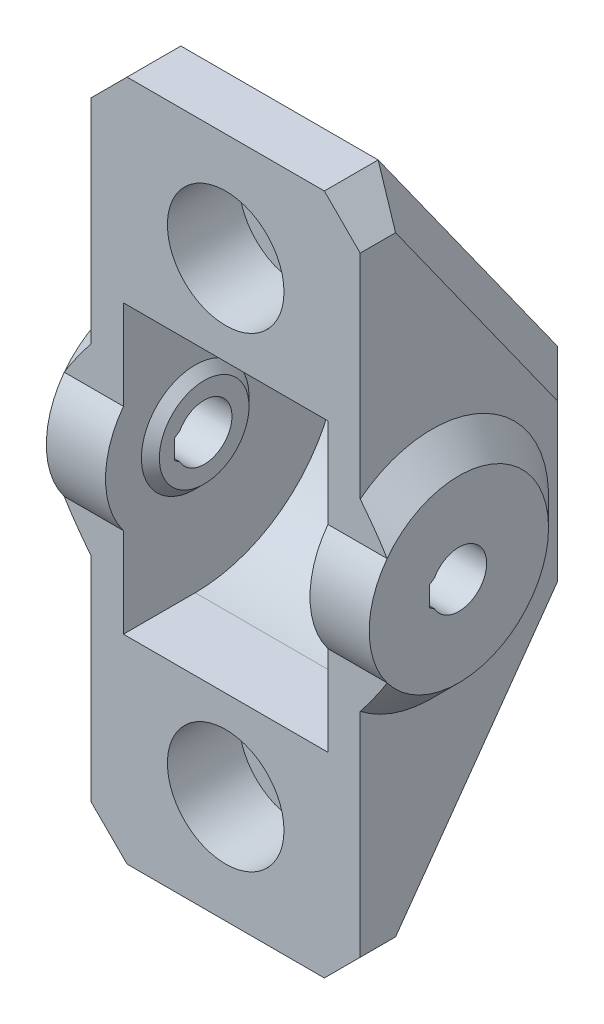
ISO-10303-21;
HEADER;
FILE_DESCRIPTION(('STEP AP214'),'2;1');
FILE_NAME('part.step','',(''),(''),'','','');
FILE_SCHEMA(('AUTOMOTIVE_DESIGN { 1 0 10303 214 1 1 1 1 }'));
ENDSEC;
DATA;
#1=APPLICATION_CONTEXT('core data for automotive mechanical design processes');
#2=APPLICATION_PROTOCOL_DEFINITION('international standard','automotive_design',2000,#1);
#3=PRODUCT_CONTEXT('',#1,'mechanical');
#4=PRODUCT('Part','Part','',(#3));
#5=PRODUCT_RELATED_PRODUCT_CATEGORY('part','',(#4));
#6=PRODUCT_DEFINITION_FORMATION('','',#4);
#7=PRODUCT_DEFINITION_CONTEXT('part definition',#1,'design');
#8=PRODUCT_DEFINITION('design','',#6,#7);
#9=PRODUCT_DEFINITION_SHAPE('','',#8);
#10=(LENGTH_UNIT() NAMED_UNIT(*) SI_UNIT(.MILLI.,.METRE.));
#11=(NAMED_UNIT(*) PLANE_ANGLE_UNIT() SI_UNIT($,.RADIAN.));
#12=(NAMED_UNIT(*) SI_UNIT($,.STERADIAN.) SOLID_ANGLE_UNIT());
#13=UNCERTAINTY_MEASURE_WITH_UNIT(LENGTH_MEASURE(1.E-05),#10,'distance_accuracy_value','');
#14=(GEOMETRIC_REPRESENTATION_CONTEXT(3) GLOBAL_UNCERTAINTY_ASSIGNED_CONTEXT((#13)) GLOBAL_UNIT_ASSIGNED_CONTEXT((#10,
#11,#12)) REPRESENTATION_CONTEXT('',''));
#15=CARTESIAN_POINT('',(0.,0.,0.));
#16=DIRECTION('',(0.,0.,1.));
#17=DIRECTION('',(1.,0.,0.));
#18=AXIS2_PLACEMENT_3D('',#15,#16,#17);
#19=CARTESIAN_POINT('',(0.,0.,16.));
#20=DIRECTION('',(0.,0.,-1.));
#21=DIRECTION('',(-1.,0.,0.));
#22=AXIS2_PLACEMENT_3D('',#19,#20,#21);
#23=PLANE('',#22);
#24=CARTESIAN_POINT('',(0.,13.,16.));
#25=DIRECTION('',(0.,0.,1.));
#26=DIRECTION('',(1.,0.,0.));
#27=AXIS2_PLACEMENT_3D('',#24,#25,#26);
#28=CIRCLE('',#27,3.25);
#29=CARTESIAN_POINT('',(3.25,13.,16.));
#30=VERTEX_POINT('',#29);
#31=EDGE_CURVE('E315',#30,#30,#28,.T.);
#32=ORIENTED_EDGE('',*,*,#31,.F.);
#33=EDGE_LOOP('',(#32));
#34=FACE_BOUND('',#33,.T.);
#35=DIRECTION('',(-1.,0.,0.));
#36=VECTOR('',#35,1.);
#37=CARTESIAN_POINT('',(7.5,19.,16.));
#38=LINE('',#37,#36);
#39=CARTESIAN_POINT('',(5.50000000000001,19.,16.));
#40=VERTEX_POINT('',#39);
#41=CARTESIAN_POINT('',(-5.49999999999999,19.,16.));
#42=VERTEX_POINT('',#41);
#43=EDGE_CURVE('E386',#40,#42,#38,.T.);
#44=ORIENTED_EDGE('',*,*,#43,.T.);
#45=DIRECTION('',(0.707106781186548,0.707106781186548,0.));
#46=VECTOR('',#45,1.);
#47=CARTESIAN_POINT('',(-7.5,17.,16.));
#48=LINE('',#47,#46);
#49=CARTESIAN_POINT('',(-7.5,17.,16.));
#50=VERTEX_POINT('',#49);
#51=EDGE_CURVE('E495',#42,#50,#48,.F.);
#52=ORIENTED_EDGE('',*,*,#51,.T.);
#53=DIRECTION('',(0.,-1.,0.));
#54=VECTOR('',#53,1.);
#55=CARTESIAN_POINT('',(-7.5,19.,16.));
#56=LINE('',#55,#54);
#57=CARTESIAN_POINT('',(-7.5,5.12347538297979,16.));
#58=VERTEX_POINT('',#57);
#59=EDGE_CURVE('E378',#50,#58,#56,.T.);
#60=ORIENTED_EDGE('',*,*,#59,.T.);
#61=CARTESIAN_POINT('',(-7.5,5.12347538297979,16.));
#62=CARTESIAN_POINT('',(-7.56711714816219,5.03832196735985,16.));
#63=CARTESIAN_POINT('',(-7.63384766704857,4.95286351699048,16.));
#64=CARTESIAN_POINT('',(-7.76642428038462,4.78125929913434,16.));
#65=CARTESIAN_POINT('',(-7.83227034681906,4.69511351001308,16.));
#66=CARTESIAN_POINT('',(-8.0281795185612,4.43570850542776,16.));
#67=CARTESIAN_POINT('',(-8.15674680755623,4.26131350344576,16.));
#68=CARTESIAN_POINT('',(-8.40870004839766,3.90869296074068,16.));
#69=CARTESIAN_POINT('',(-8.53208403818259,3.7304660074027,16.));
#70=CARTESIAN_POINT('',(-8.71192373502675,3.45952365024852,16.));
#71=CARTESIAN_POINT('',(-8.77102477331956,3.36856455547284,16.));
#72=CARTESIAN_POINT('',(-8.88715085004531,3.18531455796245,16.));
#73=CARTESIAN_POINT('',(-8.94417559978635,3.09302347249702,16.));
#74=CARTESIAN_POINT('',(-8.99999999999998,2.99999999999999,16.));
#75=B_SPLINE_CURVE_WITH_KNOTS('',3,(#61,#62,#63,#64,#65,#66,#67,#68,#69,#70,#71,#72,#73,#74),
.UNSPECIFIED.,.F.,.F.,(4,2,2,2,2,2,4),(0.,0.325271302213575,0.65055288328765,1.3004726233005,
1.95063620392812,2.27603142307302,2.60147171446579),.UNSPECIFIED.);
#76=CARTESIAN_POINT('',(-9.,2.99999999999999,16.));
#77=VERTEX_POINT('',#76);
#78=EDGE_CURVE('E445',#58,#77,#75,.T.);
#79=ORIENTED_EDGE('',*,*,#78,.T.);
#80=DIRECTION('',(1.,0.,0.));
#81=VECTOR('',#80,1.);
#82=CARTESIAN_POINT('',(-32.1421356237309,2.99999999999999,16.));
#83=LINE('',#82,#81);
#84=CARTESIAN_POINT('',(-5.7,2.99999999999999,16.));
#85=VERTEX_POINT('',#84);
#86=EDGE_CURVE('E284',#77,#85,#83,.T.);
#87=ORIENTED_EDGE('',*,*,#86,.T.);
#88=DIRECTION('',(0.,-1.,0.));
#89=VECTOR('',#88,1.);
#90=CARTESIAN_POINT('',(-5.7,8.,16.));
#91=LINE('',#90,#89);
#92=CARTESIAN_POINT('',(-5.7,8.,16.));
#93=VERTEX_POINT('',#92);
#94=EDGE_CURVE('E351',#93,#85,#91,.T.);
#95=ORIENTED_EDGE('',*,*,#94,.F.);
#96=DIRECTION('',(1.,0.,0.));
#97=VECTOR('',#96,1.);
#98=CARTESIAN_POINT('',(-5.7,8.,16.));
#99=LINE('',#98,#97);
#100=CARTESIAN_POINT('',(5.7,8.,16.));
#101=VERTEX_POINT('',#100);
#102=EDGE_CURVE('E374',#93,#101,#99,.T.);
#103=ORIENTED_EDGE('',*,*,#102,.T.);
#104=DIRECTION('',(0.,-1.,0.));
#105=VECTOR('',#104,1.);
#106=CARTESIAN_POINT('',(5.7,8.,16.));
#107=LINE('',#106,#105);
#108=CARTESIAN_POINT('',(5.7,2.99999999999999,16.));
#109=VERTEX_POINT('',#108);
#110=EDGE_CURVE('E364',#101,#109,#107,.T.);
#111=ORIENTED_EDGE('',*,*,#110,.T.);
#112=DIRECTION('',(-1.,0.,0.));
#113=VECTOR('',#112,1.);
#114=CARTESIAN_POINT('',(32.1421356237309,2.99999999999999,16.));
#115=LINE('',#114,#113);
#116=CARTESIAN_POINT('',(9.,2.99999999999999,16.));
#117=VERTEX_POINT('',#116);
#118=EDGE_CURVE('E294',#109,#117,#115,.F.);
#119=ORIENTED_EDGE('',*,*,#118,.T.);
#120=CARTESIAN_POINT('',(8.99999999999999,2.99999999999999,16.));
#121=CARTESIAN_POINT('',(8.94417559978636,3.09302347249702,16.));
#122=CARTESIAN_POINT('',(8.88715085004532,3.18531455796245,16.));
#123=CARTESIAN_POINT('',(8.77102477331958,3.36856455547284,16.));
#124=CARTESIAN_POINT('',(8.71192373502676,3.45952365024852,16.));
#125=CARTESIAN_POINT('',(8.5320840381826,3.7304660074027,16.));
#126=CARTESIAN_POINT('',(8.40870004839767,3.90869296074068,16.));
#127=CARTESIAN_POINT('',(8.15674680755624,4.26131350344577,16.));
#128=CARTESIAN_POINT('',(8.02817951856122,4.43570850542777,16.));
#129=CARTESIAN_POINT('',(7.83227034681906,4.69511351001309,16.));
#130=CARTESIAN_POINT('',(7.76642428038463,4.78125929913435,16.));
#131=CARTESIAN_POINT('',(7.63384766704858,4.95286351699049,16.));
#132=CARTESIAN_POINT('',(7.56711714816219,5.03832196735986,16.));
#133=CARTESIAN_POINT('',(7.5,5.1234753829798,16.));
#134=B_SPLINE_CURVE_WITH_KNOTS('',3,(#120,#121,#122,#123,#124,#125,#126,#127,#128,#129,#130,
#131,#132,#133),.UNSPECIFIED.,.F.,.F.,(4,2,2,2,2,2,4),(0.,0.32544029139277,0.650835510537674,
1.3009990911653,1.95091883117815,2.27620041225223,2.60147171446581),.UNSPECIFIED.);
#135=CARTESIAN_POINT('',(7.5,5.1234753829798,16.));
#136=VERTEX_POINT('',#135);
#137=EDGE_CURVE('E416',#117,#136,#134,.T.);
#138=ORIENTED_EDGE('',*,*,#137,.T.);
#139=DIRECTION('',(0.,1.,0.));
#140=VECTOR('',#139,1.);
#141=CARTESIAN_POINT('',(7.5,19.,16.));
#142=LINE('',#141,#140);
#143=CARTESIAN_POINT('',(7.5,17.,16.));
#144=VERTEX_POINT('',#143);
#145=EDGE_CURVE('E383',#136,#144,#142,.T.);
#146=ORIENTED_EDGE('',*,*,#145,.T.);
#147=DIRECTION('',(0.707106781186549,-0.707106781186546,0.));
#148=VECTOR('',#147,1.);
#149=CARTESIAN_POINT('',(5.50000000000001,19.,16.));
#150=LINE('',#149,#148);
#151=EDGE_CURVE('E493',#144,#40,#150,.F.);
#152=ORIENTED_EDGE('',*,*,#151,.T.);
#153=EDGE_LOOP('',(#44,#52,#60,#79,#87,#95,#103,#111,#119,#138,#146,#152));
#154=FACE_BOUND('',#153,.T.);
#155=ADVANCED_FACE('F39',(#34,#154),#23,.F.);
#156=CARTESIAN_POINT('',(-7.5,19.,16.));
#157=DIRECTION('',(1.,0.,0.));
#158=DIRECTION('',(0.,1.,0.));
#159=AXIS2_PLACEMENT_3D('',#156,#157,#158);
#160=PLANE('',#159);
#161=DIRECTION('',(0.,-0.813733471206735,0.581238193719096));
#162=VECTOR('',#161,1.);
#163=CARTESIAN_POINT('',(-7.49999999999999,-17.8375236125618,14.6274669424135));
#164=LINE('',#163,#162);
#165=CARTESIAN_POINT('',(-7.5,-4.35906989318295,5.00000000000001));
#166=VERTEX_POINT('',#165);
#167=CARTESIAN_POINT('',(-7.49999999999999,-17.,14.0292357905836));
#168=VERTEX_POINT('',#167);
#169=EDGE_CURVE('E468',#166,#168,#164,.T.);
#170=ORIENTED_EDGE('',*,*,#169,.T.);
#171=DIRECTION('',(0.,0.,1.));
#172=VECTOR('',#171,1.);
#173=CARTESIAN_POINT('',(-7.49999999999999,-17.,16.));
#174=LINE('',#173,#172);
#175=CARTESIAN_POINT('',(-7.49999999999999,-17.,16.));
#176=VERTEX_POINT('',#175);
#177=EDGE_CURVE('E470',#168,#176,#174,.T.);
#178=ORIENTED_EDGE('',*,*,#177,.T.);
#179=CARTESIAN_POINT('',(-7.5,-5.12347538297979,16.));
#180=VERTEX_POINT('',#179);
#181=EDGE_CURVE('E370',#180,#176,#56,.T.);
#182=ORIENTED_EDGE('',*,*,#181,.F.);
#183=CARTESIAN_POINT('',(-7.5,0.,12.));
#184=DIRECTION('',(1.,0.,0.));
#185=DIRECTION('',(0.,1.,0.));
#186=AXIS2_PLACEMENT_3D('',#183,#184,#185);
#187=CIRCLE('',#186,6.49999999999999);
#188=EDGE_CURVE('E404',#180,#58,#187,.T.);
#189=ORIENTED_EDGE('',*,*,#188,.T.);
#190=ORIENTED_EDGE('',*,*,#59,.F.);
#191=DIRECTION('',(0.,0.,-1.));
#192=VECTOR('',#191,1.);
#193=CARTESIAN_POINT('',(-7.5,17.,16.));
#194=LINE('',#193,#192);
#195=CARTESIAN_POINT('',(-7.5,17.,14.0292357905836));
#196=VERTEX_POINT('',#195);
#197=EDGE_CURVE('E462',#50,#196,#194,.T.);
#198=ORIENTED_EDGE('',*,*,#197,.T.);
#199=DIRECTION('',(0.,-0.813733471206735,-0.581238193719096));
#200=VECTOR('',#199,1.);
#201=CARTESIAN_POINT('',(-7.5,19.2564425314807,15.640980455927));
#202=LINE('',#201,#200);
#203=CARTESIAN_POINT('',(-7.5,4.35906989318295,5.00000000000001));
#204=VERTEX_POINT('',#203);
#205=EDGE_CURVE('E464',#196,#204,#202,.T.);
#206=ORIENTED_EDGE('',*,*,#205,.T.);
#207=DIRECTION('',(0.,-1.,0.));
#208=VECTOR('',#207,1.);
#209=CARTESIAN_POINT('',(-7.5,19.,5.00000000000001));
#210=LINE('',#209,#208);
#211=EDGE_CURVE('E466',#204,#166,#210,.T.);
#212=ORIENTED_EDGE('',*,*,#211,.T.);
#213=EDGE_LOOP('',(#170,#178,#182,#189,#190,#198,#206,#212));
#214=FACE_BOUND('',#213,.T.);
#215=ADVANCED_FACE('F572',(#214),#160,.F.);
#216=CARTESIAN_POINT('',(7.50000000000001,-19.,16.));
#217=DIRECTION('',(0.,1.,0.));
#218=DIRECTION('',(-1.,0.,0.));
#219=AXIS2_PLACEMENT_3D('',#216,#217,#218);
#220=PLANE('',#219);
#221=DIRECTION('',(1.,0.,0.));
#222=VECTOR('',#221,1.);
#223=CARTESIAN_POINT('',(7.50000000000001,-19.,16.));
#224=LINE('',#223,#222);
#225=CARTESIAN_POINT('',(-5.49999999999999,-19.,16.));
#226=VERTEX_POINT('',#225);
#227=CARTESIAN_POINT('',(5.50000000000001,-19.,16.));
#228=VERTEX_POINT('',#227);
#229=EDGE_CURVE('E380',#226,#228,#224,.T.);
#230=ORIENTED_EDGE('',*,*,#229,.F.);
#231=DIRECTION('',(0.,0.,-1.));
#232=VECTOR('',#231,1.);
#233=CARTESIAN_POINT('',(-5.49999999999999,-19.,16.));
#234=LINE('',#233,#232);
#235=CARTESIAN_POINT('',(-5.49999999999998,-19.,13.));
#236=VERTEX_POINT('',#235);
#237=EDGE_CURVE('E459',#226,#236,#234,.T.);
#238=ORIENTED_EDGE('',*,*,#237,.T.);
#239=DIRECTION('',(1.,0.,0.));
#240=VECTOR('',#239,1.);
#241=CARTESIAN_POINT('',(-7.5,-19.,13.));
#242=LINE('',#241,#240);
#243=CARTESIAN_POINT('',(5.50000000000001,-19.,13.));
#244=VERTEX_POINT('',#243);
#245=EDGE_CURVE('E302',#236,#244,#242,.T.);
#246=ORIENTED_EDGE('',*,*,#245,.T.);
#247=DIRECTION('',(0.,0.,1.));
#248=VECTOR('',#247,1.);
#249=CARTESIAN_POINT('',(5.50000000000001,-19.,16.));
#250=LINE('',#249,#248);
#251=EDGE_CURVE('E457',#244,#228,#250,.T.);
#252=ORIENTED_EDGE('',*,*,#251,.T.);
#253=EDGE_LOOP('',(#230,#238,#246,#252));
#254=FACE_BOUND('',#253,.T.);
#255=ADVANCED_FACE('F577',(#254),#220,.F.);
#256=CARTESIAN_POINT('',(7.5,19.,16.));
#257=DIRECTION('',(-1.,0.,0.));
#258=DIRECTION('',(0.,-1.,0.));
#259=AXIS2_PLACEMENT_3D('',#256,#257,#258);
#260=PLANE('',#259);
#261=DIRECTION('',(0.,0.813733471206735,0.581238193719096));
#262=VECTOR('',#261,1.);
#263=CARTESIAN_POINT('',(7.5,19.2564425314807,15.640980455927));
#264=LINE('',#263,#262);
#265=CARTESIAN_POINT('',(7.5,4.35906989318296,4.99999999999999));
#266=VERTEX_POINT('',#265);
#267=CARTESIAN_POINT('',(7.5,17.,14.0292357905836));
#268=VERTEX_POINT('',#267);
#269=EDGE_CURVE('E503',#266,#268,#264,.T.);
#270=ORIENTED_EDGE('',*,*,#269,.T.);
#271=DIRECTION('',(0.,0.,1.));
#272=VECTOR('',#271,1.);
#273=CARTESIAN_POINT('',(7.5,17.,16.));
#274=LINE('',#273,#272);
#275=EDGE_CURVE('E505',#268,#144,#274,.T.);
#276=ORIENTED_EDGE('',*,*,#275,.T.);
#277=ORIENTED_EDGE('',*,*,#145,.F.);
#278=CARTESIAN_POINT('',(7.5,0.,12.));
#279=DIRECTION('',(-1.,0.,0.));
#280=DIRECTION('',(0.,-1.,0.));
#281=AXIS2_PLACEMENT_3D('',#278,#279,#280);
#282=CIRCLE('',#281,6.5);
#283=CARTESIAN_POINT('',(7.5,-5.1234753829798,16.));
#284=VERTEX_POINT('',#283);
#285=EDGE_CURVE('E395',#136,#284,#282,.T.);
#286=ORIENTED_EDGE('',*,*,#285,.T.);
#287=CARTESIAN_POINT('',(7.50000000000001,-17.,16.));
#288=VERTEX_POINT('',#287);
#289=EDGE_CURVE('E384',#288,#284,#142,.T.);
#290=ORIENTED_EDGE('',*,*,#289,.F.);
#291=DIRECTION('',(0.,0.,-1.));
#292=VECTOR('',#291,1.);
#293=CARTESIAN_POINT('',(7.50000000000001,-17.,16.));
#294=LINE('',#293,#292);
#295=CARTESIAN_POINT('',(7.50000000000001,-17.,14.0292357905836));
#296=VERTEX_POINT('',#295);
#297=EDGE_CURVE('E497',#288,#296,#294,.T.);
#298=ORIENTED_EDGE('',*,*,#297,.T.);
#299=DIRECTION('',(0.,0.813733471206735,-0.581238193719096));
#300=VECTOR('',#299,1.);
#301=CARTESIAN_POINT('',(7.5,-3.83752361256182,4.62746694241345));
#302=LINE('',#301,#300);
#303=CARTESIAN_POINT('',(7.5,-4.35906989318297,4.99999999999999));
#304=VERTEX_POINT('',#303);
#305=EDGE_CURVE('E499',#296,#304,#302,.T.);
#306=ORIENTED_EDGE('',*,*,#305,.T.);
#307=DIRECTION('',(0.,1.,0.));
#308=VECTOR('',#307,1.);
#309=CARTESIAN_POINT('',(7.5,19.,4.99999999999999));
#310=LINE('',#309,#308);
#311=EDGE_CURVE('E501',#304,#266,#310,.T.);
#312=ORIENTED_EDGE('',*,*,#311,.T.);
#313=EDGE_LOOP('',(#270,#276,#277,#286,#290,#298,#306,#312));
#314=FACE_BOUND('',#313,.T.);
#315=ADVANCED_FACE('F592',(#314),#260,.F.);
#316=CARTESIAN_POINT('',(0.,-13.,16.));
#317=DIRECTION('',(0.,0.,1.));
#318=DIRECTION('',(1.,0.,0.));
#319=AXIS2_PLACEMENT_3D('',#316,#317,#318);
#320=CYLINDRICAL_SURFACE('',#319,1.7);
#321=CARTESIAN_POINT('',(0.,-13.,12.));
#322=DIRECTION('',(0.,0.,1.));
#323=DIRECTION('',(1.,0.,0.));
#324=AXIS2_PLACEMENT_3D('',#321,#322,#323);
#325=CIRCLE('',#324,1.7);
#326=CARTESIAN_POINT('',(1.7,-13.,12.));
#327=VERTEX_POINT('',#326);
#328=EDGE_CURVE('E330',#327,#327,#325,.T.);
#329=ORIENTED_EDGE('',*,*,#328,.T.);
#330=EDGE_LOOP('',(#329));
#331=FACE_BOUND('',#330,.T.);
#332=CARTESIAN_POINT('',(0.,-13.,8.71428571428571));
#333=DIRECTION('',(0.,-0.581238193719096,-0.813733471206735));
#334=DIRECTION('',(0.,-0.813733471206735,0.581238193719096));
#335=AXIS2_PLACEMENT_3D('',#332,#333,#334);
#336=ELLIPSE('',#335,2.08913613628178,1.7);
#337=CARTESIAN_POINT('',(0.,-14.7,9.92857142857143));
#338=VERTEX_POINT('',#337);
#339=EDGE_CURVE('E305',#338,#338,#336,.F.);
#340=ORIENTED_EDGE('',*,*,#339,.F.);
#341=EDGE_LOOP('',(#340));
#342=FACE_BOUND('',#341,.T.);
#343=ADVANCED_FACE('F584',(#331,#342),#320,.F.);
#344=CARTESIAN_POINT('',(0.,-13.,16.));
#345=DIRECTION('',(0.,0.,1.));
#346=DIRECTION('',(1.,0.,0.));
#347=AXIS2_PLACEMENT_3D('',#344,#345,#346);
#348=CIRCLE('',#347,3.25);
#349=CARTESIAN_POINT('',(3.25,-13.,16.));
#350=VERTEX_POINT('',#349);
#351=EDGE_CURVE('E324',#350,#350,#348,.T.);
#352=ORIENTED_EDGE('',*,*,#351,.F.);
#353=EDGE_LOOP('',(#352));
#354=FACE_BOUND('',#353,.T.);
#355=ORIENTED_EDGE('',*,*,#181,.T.);
#356=DIRECTION('',(-0.707106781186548,0.707106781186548,0.));
#357=VECTOR('',#356,1.);
#358=CARTESIAN_POINT('',(-5.49999999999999,-19.,16.));
#359=LINE('',#358,#357);
#360=EDGE_CURVE('E474',#176,#226,#359,.F.);
#361=ORIENTED_EDGE('',*,*,#360,.T.);
#362=ORIENTED_EDGE('',*,*,#229,.T.);
#363=DIRECTION('',(-0.707106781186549,-0.707106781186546,0.));
#364=VECTOR('',#363,1.);
#365=CARTESIAN_POINT('',(7.50000000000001,-17.,16.));
#366=LINE('',#365,#364);
#367=EDGE_CURVE('E472',#228,#288,#366,.F.);
#368=ORIENTED_EDGE('',*,*,#367,.T.);
#369=ORIENTED_EDGE('',*,*,#289,.T.);
#370=CARTESIAN_POINT('',(7.5,-5.1234753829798,16.));
#371=CARTESIAN_POINT('',(7.56711714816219,-5.03832196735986,16.));
#372=CARTESIAN_POINT('',(7.63384766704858,-4.95286351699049,16.));
#373=CARTESIAN_POINT('',(7.76642428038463,-4.78125929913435,16.));
#374=CARTESIAN_POINT('',(7.83227034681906,-4.69511351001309,16.));
#375=CARTESIAN_POINT('',(8.02817951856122,-4.43570850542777,16.));
#376=CARTESIAN_POINT('',(8.15674680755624,-4.26131350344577,16.));
#377=CARTESIAN_POINT('',(8.40870004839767,-3.90869296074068,16.));
#378=CARTESIAN_POINT('',(8.5320840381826,-3.7304660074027,16.));
#379=CARTESIAN_POINT('',(8.71192373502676,-3.45952365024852,16.));
#380=CARTESIAN_POINT('',(8.77102477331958,-3.36856455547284,16.));
#381=CARTESIAN_POINT('',(8.88715085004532,-3.18531455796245,16.));
#382=CARTESIAN_POINT('',(8.94417559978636,-3.09302347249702,16.));
#383=CARTESIAN_POINT('',(8.99999999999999,-2.99999999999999,16.));
#384=B_SPLINE_CURVE_WITH_KNOTS('',3,(#370,#371,#372,#373,#374,#375,#376,#377,#378,#379,#380,
#381,#382,#383),.UNSPECIFIED.,.F.,.F.,(4,2,2,2,2,2,4),(0.,0.325271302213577,0.650552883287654,
1.3004726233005,1.95063620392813,2.27603142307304,2.60147171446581),.UNSPECIFIED.);
#385=CARTESIAN_POINT('',(9.,-2.99999999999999,16.));
#386=VERTEX_POINT('',#385);
#387=EDGE_CURVE('E407',#284,#386,#384,.T.);
#388=ORIENTED_EDGE('',*,*,#387,.T.);
#389=DIRECTION('',(-1.,0.,0.));
#390=VECTOR('',#389,1.);
#391=CARTESIAN_POINT('',(32.1421356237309,-2.99999999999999,16.));
#392=LINE('',#391,#390);
#393=CARTESIAN_POINT('',(5.7,-2.99999999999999,16.));
#394=VERTEX_POINT('',#393);
#395=EDGE_CURVE('E298',#386,#394,#392,.T.);
#396=ORIENTED_EDGE('',*,*,#395,.T.);
#397=CARTESIAN_POINT('',(5.7,-8.,16.));
#398=VERTEX_POINT('',#397);
#399=EDGE_CURVE('E363',#394,#398,#107,.T.);
#400=ORIENTED_EDGE('',*,*,#399,.T.);
#401=DIRECTION('',(1.,0.,0.));
#402=VECTOR('',#401,1.);
#403=CARTESIAN_POINT('',(-5.7,-8.,16.));
#404=LINE('',#403,#402);
#405=CARTESIAN_POINT('',(-5.7,-8.,16.));
#406=VERTEX_POINT('',#405);
#407=EDGE_CURVE('E371',#406,#398,#404,.T.);
#408=ORIENTED_EDGE('',*,*,#407,.F.);
#409=CARTESIAN_POINT('',(-5.7,-2.99999999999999,16.));
#410=VERTEX_POINT('',#409);
#411=EDGE_CURVE('E350',#410,#406,#91,.T.);
#412=ORIENTED_EDGE('',*,*,#411,.F.);
#413=DIRECTION('',(1.,0.,0.));
#414=VECTOR('',#413,1.);
#415=CARTESIAN_POINT('',(-32.1421356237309,-2.99999999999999,16.));
#416=LINE('',#415,#414);
#417=CARTESIAN_POINT('',(-9.,-2.99999999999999,16.));
#418=VERTEX_POINT('',#417);
#419=EDGE_CURVE('E282',#410,#418,#416,.F.);
#420=ORIENTED_EDGE('',*,*,#419,.T.);
#421=CARTESIAN_POINT('',(-8.99999999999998,-2.99999999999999,16.));
#422=CARTESIAN_POINT('',(-8.94417559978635,-3.09302347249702,16.));
#423=CARTESIAN_POINT('',(-8.88715085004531,-3.18531455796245,16.));
#424=CARTESIAN_POINT('',(-8.77102477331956,-3.36856455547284,16.));
#425=CARTESIAN_POINT('',(-8.71192373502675,-3.45952365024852,16.));
#426=CARTESIAN_POINT('',(-8.53208403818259,-3.7304660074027,16.));
#427=CARTESIAN_POINT('',(-8.40870004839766,-3.90869296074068,16.));
#428=CARTESIAN_POINT('',(-8.15674680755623,-4.26131350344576,16.));
#429=CARTESIAN_POINT('',(-8.0281795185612,-4.43570850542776,16.));
#430=CARTESIAN_POINT('',(-7.83227034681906,-4.69511351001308,16.));
#431=CARTESIAN_POINT('',(-7.76642428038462,-4.78125929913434,16.));
#432=CARTESIAN_POINT('',(-7.63384766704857,-4.95286351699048,16.));
#433=CARTESIAN_POINT('',(-7.56711714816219,-5.03832196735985,16.));
#434=CARTESIAN_POINT('',(-7.5,-5.12347538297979,16.));
#435=B_SPLINE_CURVE_WITH_KNOTS('',3,(#421,#422,#423,#424,#425,#426,#427,#428,#429,#430,#431,
#432,#433,#434),.UNSPECIFIED.,.F.,.F.,(4,2,2,2,2,2,4),(0.,0.32544029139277,0.650835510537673,
1.3009990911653,1.95091883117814,2.27620041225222,2.6014717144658),.UNSPECIFIED.);
#436=EDGE_CURVE('E451',#418,#180,#435,.T.);
#437=ORIENTED_EDGE('',*,*,#436,.T.);
#438=EDGE_LOOP('',(#355,#361,#362,#368,#369,#388,#396,#400,#408,#412,#420,#437));
#439=FACE_BOUND('',#438,.T.);
#440=ADVANCED_FACE('F422',(#354,#439),#23,.F.);
#441=CARTESIAN_POINT('',(7.5,19.,16.));
#442=DIRECTION('',(0.,-1.,0.));
#443=DIRECTION('',(1.,0.,0.));
#444=AXIS2_PLACEMENT_3D('',#441,#442,#443);
#445=PLANE('',#444);
#446=DIRECTION('',(1.,0.,0.));
#447=VECTOR('',#446,1.);
#448=CARTESIAN_POINT('',(-7.5,19.,13.));
#449=LINE('',#448,#447);
#450=CARTESIAN_POINT('',(-5.49999999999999,19.,13.));
#451=VERTEX_POINT('',#450);
#452=CARTESIAN_POINT('',(5.50000000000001,19.,13.));
#453=VERTEX_POINT('',#452);
#454=EDGE_CURVE('E312',#451,#453,#449,.T.);
#455=ORIENTED_EDGE('',*,*,#454,.F.);
#456=DIRECTION('',(0.,0.,1.));
#457=VECTOR('',#456,1.);
#458=CARTESIAN_POINT('',(-5.49999999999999,19.,16.));
#459=LINE('',#458,#457);
#460=EDGE_CURVE('E491',#451,#42,#459,.T.);
#461=ORIENTED_EDGE('',*,*,#460,.T.);
#462=ORIENTED_EDGE('',*,*,#43,.F.);
#463=DIRECTION('',(0.,0.,-1.));
#464=VECTOR('',#463,1.);
#465=CARTESIAN_POINT('',(5.50000000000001,19.,16.));
#466=LINE('',#465,#464);
#467=EDGE_CURVE('E488',#40,#453,#466,.T.);
#468=ORIENTED_EDGE('',*,*,#467,.T.);
#469=EDGE_LOOP('',(#455,#461,#462,#468));
#470=FACE_BOUND('',#469,.T.);
#471=ADVANCED_FACE('F583',(#470),#445,.F.);
#472=CARTESIAN_POINT('',(-5.7,0.,12.));
#473=DIRECTION('',(1.,0.,0.));
#474=DIRECTION('',(0.,0.,-1.));
#475=AXIS2_PLACEMENT_3D('',#472,#473,#474);
#476=CYLINDRICAL_SURFACE('',#475,8.);
#477=CARTESIAN_POINT('',(5.7,0.,12.));
#478=DIRECTION('',(1.,0.,0.));
#479=DIRECTION('',(0.,0.,-1.));
#480=AXIS2_PLACEMENT_3D('',#477,#478,#479);
#481=CIRCLE('',#480,8.);
#482=CARTESIAN_POINT('',(5.7,-8.,12.));
#483=VERTEX_POINT('',#482);
#484=CARTESIAN_POINT('',(5.7,8.,12.));
#485=VERTEX_POINT('',#484);
#486=EDGE_CURVE('E342',#483,#485,#481,.T.);
#487=ORIENTED_EDGE('',*,*,#486,.T.);
#488=DIRECTION('',(1.,0.,0.));
#489=VECTOR('',#488,1.);
#490=CARTESIAN_POINT('',(-5.7,8.,12.));
#491=LINE('',#490,#489);
#492=CARTESIAN_POINT('',(-5.7,8.,12.));
#493=VERTEX_POINT('',#492);
#494=EDGE_CURVE('E357',#493,#485,#491,.T.);
#495=ORIENTED_EDGE('',*,*,#494,.F.);
#496=CARTESIAN_POINT('',(-5.7,0.,12.));
#497=DIRECTION('',(1.,0.,0.));
#498=DIRECTION('',(0.,0.,-1.));
#499=AXIS2_PLACEMENT_3D('',#496,#497,#498);
#500=CIRCLE('',#499,8.);
#501=CARTESIAN_POINT('',(-5.7,-8.,12.));
#502=VERTEX_POINT('',#501);
#503=EDGE_CURVE('E343',#502,#493,#500,.T.);
#504=ORIENTED_EDGE('',*,*,#503,.F.);
#505=DIRECTION('',(1.,0.,0.));
#506=VECTOR('',#505,1.);
#507=CARTESIAN_POINT('',(-5.7,-8.,12.));
#508=LINE('',#507,#506);
#509=EDGE_CURVE('E368',#502,#483,#508,.T.);
#510=ORIENTED_EDGE('',*,*,#509,.T.);
#511=EDGE_LOOP('',(#487,#495,#504,#510));
#512=FACE_BOUND('',#511,.T.);
#513=ADVANCED_FACE('F590',(#512),#476,.F.);
#514=CARTESIAN_POINT('',(-5.7,-8.,12.));
#515=DIRECTION('',(0.,-1.,0.));
#516=DIRECTION('',(0.,0.,-1.));
#517=AXIS2_PLACEMENT_3D('',#514,#515,#516);
#518=PLANE('',#517);
#519=DIRECTION('',(0.,0.,-1.));
#520=VECTOR('',#519,1.);
#521=CARTESIAN_POINT('',(5.7,-8.,12.));
#522=LINE('',#521,#520);
#523=EDGE_CURVE('E347',#398,#483,#522,.T.);
#524=ORIENTED_EDGE('',*,*,#523,.T.);
#525=ORIENTED_EDGE('',*,*,#509,.F.);
#526=DIRECTION('',(0.,0.,-1.));
#527=VECTOR('',#526,1.);
#528=CARTESIAN_POINT('',(-5.7,-8.,12.));
#529=LINE('',#528,#527);
#530=EDGE_CURVE('E354',#406,#502,#529,.T.);
#531=ORIENTED_EDGE('',*,*,#530,.F.);
#532=ORIENTED_EDGE('',*,*,#407,.T.);
#533=EDGE_LOOP('',(#524,#525,#531,#532));
#534=FACE_BOUND('',#533,.T.);
#535=ADVANCED_FACE('F697',(#534),#518,.F.);
#536=CARTESIAN_POINT('',(-5.7,8.,12.));
#537=DIRECTION('',(0.,1.,0.));
#538=DIRECTION('',(0.,0.,1.));
#539=AXIS2_PLACEMENT_3D('',#536,#537,#538);
#540=PLANE('',#539);
#541=DIRECTION('',(0.,0.,1.));
#542=VECTOR('',#541,1.);
#543=CARTESIAN_POINT('',(5.7,8.,12.));
#544=LINE('',#543,#542);
#545=EDGE_CURVE('E360',#485,#101,#544,.T.);
#546=ORIENTED_EDGE('',*,*,#545,.T.);
#547=ORIENTED_EDGE('',*,*,#102,.F.);
#548=DIRECTION('',(0.,0.,1.));
#549=VECTOR('',#548,1.);
#550=CARTESIAN_POINT('',(-5.7,8.,12.));
#551=LINE('',#550,#549);
#552=EDGE_CURVE('E346',#493,#93,#551,.T.);
#553=ORIENTED_EDGE('',*,*,#552,.F.);
#554=ORIENTED_EDGE('',*,*,#494,.T.);
#555=EDGE_LOOP('',(#546,#547,#553,#554));
#556=FACE_BOUND('',#555,.T.);
#557=ADVANCED_FACE('F567',(#556),#540,.F.);
#558=CARTESIAN_POINT('',(-5.7,0.,12.));
#559=DIRECTION('',(1.,0.,0.));
#560=DIRECTION('',(0.,0.,-1.));
#561=AXIS2_PLACEMENT_3D('',#558,#559,#560);
#562=PLANE('',#561);
#563=ORIENTED_EDGE('',*,*,#94,.T.);
#564=CARTESIAN_POINT('',(-5.7,0.,12.));
#565=DIRECTION('',(1.,0.,0.));
#566=DIRECTION('',(0.,0.,-1.));
#567=AXIS2_PLACEMENT_3D('',#564,#565,#566);
#568=CIRCLE('',#567,5.);
#569=EDGE_CURVE('E277',#85,#410,#568,.T.);
#570=ORIENTED_EDGE('',*,*,#569,.T.);
#571=ORIENTED_EDGE('',*,*,#411,.T.);
#572=ORIENTED_EDGE('',*,*,#530,.T.);
#573=ORIENTED_EDGE('',*,*,#503,.T.);
#574=ORIENTED_EDGE('',*,*,#552,.T.);
#575=EDGE_LOOP('',(#563,#570,#571,#572,#573,#574));
#576=FACE_BOUND('',#575,.T.);
#577=CARTESIAN_POINT('',(-5.7,0.,12.));
#578=DIRECTION('',(1.,0.,0.));
#579=DIRECTION('',(0.,0.,-1.));
#580=AXIS2_PLACEMENT_3D('',#577,#578,#579);
#581=CIRCLE('',#580,2.99999999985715);
#582=CARTESIAN_POINT('',(-5.7,0.,9.00000000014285));
#583=VERTEX_POINT('',#582);
#584=EDGE_CURVE('E389',#583,#583,#581,.F.);
#585=ORIENTED_EDGE('',*,*,#584,.T.);
#586=EDGE_LOOP('',(#585));
#587=FACE_BOUND('',#586,.T.);
#588=ADVANCED_FACE('F561',(#576,#587),#562,.T.);
#589=CARTESIAN_POINT('',(5.7,0.,12.));
#590=DIRECTION('',(1.,0.,0.));
#591=DIRECTION('',(0.,0.,-1.));
#592=AXIS2_PLACEMENT_3D('',#589,#590,#591);
#593=PLANE('',#592);
#594=ORIENTED_EDGE('',*,*,#399,.F.);
#595=CARTESIAN_POINT('',(5.7,0.,12.));
#596=DIRECTION('',(-1.,0.,0.));
#597=DIRECTION('',(0.,0.,1.));
#598=AXIS2_PLACEMENT_3D('',#595,#596,#597);
#599=CIRCLE('',#598,5.);
#600=EDGE_CURVE('E288',#394,#109,#599,.T.);
#601=ORIENTED_EDGE('',*,*,#600,.T.);
#602=ORIENTED_EDGE('',*,*,#110,.F.);
#603=ORIENTED_EDGE('',*,*,#545,.F.);
#604=ORIENTED_EDGE('',*,*,#486,.F.);
#605=ORIENTED_EDGE('',*,*,#523,.F.);
#606=EDGE_LOOP('',(#594,#601,#602,#603,#604,#605));
#607=FACE_BOUND('',#606,.T.);
#608=CARTESIAN_POINT('',(5.7,0.,12.));
#609=DIRECTION('',(1.,0.,0.));
#610=DIRECTION('',(0.,0.,-1.));
#611=AXIS2_PLACEMENT_3D('',#608,#609,#610);
#612=CIRCLE('',#611,3.00000000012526);
#613=CARTESIAN_POINT('',(5.7,0.,8.99999999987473));
#614=VERTEX_POINT('',#613);
#615=EDGE_CURVE('E392',#614,#614,#612,.T.);
#616=ORIENTED_EDGE('',*,*,#615,.T.);
#617=EDGE_LOOP('',(#616));
#618=FACE_BOUND('',#617,.T.);
#619=ADVANCED_FACE('F550',(#607,#618),#593,.F.);
#620=CARTESIAN_POINT('',(5.2,0.,12.));
#621=DIRECTION('',(1.,0.,0.));
#622=DIRECTION('',(0.,0.,-1.));
#623=AXIS2_PLACEMENT_3D('',#620,#621,#622);
#624=PLANE('',#623);
#625=CARTESIAN_POINT('',(5.2,0.,12.));
#626=DIRECTION('',(1.,0.,0.));
#627=DIRECTION('',(0.,0.,-1.));
#628=AXIS2_PLACEMENT_3D('',#625,#626,#627);
#629=CIRCLE('',#628,1.55);
#630=CARTESIAN_POINT('',(5.2,-0.751005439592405,13.3559095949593));
#631=VERTEX_POINT('',#630);
#632=CARTESIAN_POINT('',(5.2,0.7510054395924,13.3559095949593));
#633=VERTEX_POINT('',#632);
#634=EDGE_CURVE('E334',#631,#633,#629,.T.);
#635=ORIENTED_EDGE('',*,*,#634,.T.);
#636=DIRECTION('',(0.,0.568608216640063,-0.822608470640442));
#637=VECTOR('',#636,1.);
#638=CARTESIAN_POINT('',(5.2,0.547722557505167,13.65));
#639=LINE('',#638,#637);
#640=CARTESIAN_POINT('',(5.2,0.547722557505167,13.65));
#641=VERTEX_POINT('',#640);
#642=EDGE_CURVE('E14',#633,#641,#639,.F.);
#643=ORIENTED_EDGE('',*,*,#642,.T.);
#644=DIRECTION('',(0.,-1.,0.));
#645=VECTOR('',#644,1.);
#646=CARTESIAN_POINT('',(5.2,0.,13.65));
#647=LINE('',#646,#645);
#648=CARTESIAN_POINT('',(5.2,-0.547722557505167,13.65));
#649=VERTEX_POINT('',#648);
#650=EDGE_CURVE('E252',#641,#649,#647,.T.);
#651=ORIENTED_EDGE('',*,*,#650,.T.);
#652=DIRECTION('',(0.,0.568608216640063,0.822608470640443));
#653=VECTOR('',#652,1.);
#654=CARTESIAN_POINT('',(5.2,-0.751005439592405,13.3559095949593));
#655=LINE('',#654,#653);
#656=EDGE_CURVE('E47',#649,#631,#655,.F.);
#657=ORIENTED_EDGE('',*,*,#656,.T.);
#658=EDGE_LOOP('',(#635,#643,#651,#657));
#659=FACE_BOUND('',#658,.T.);
#660=CARTESIAN_POINT('',(5.2,0.,12.));
#661=DIRECTION('',(1.,0.,0.));
#662=DIRECTION('',(0.,0.,-1.));
#663=AXIS2_PLACEMENT_3D('',#660,#661,#662);
#664=CIRCLE('',#663,2.5);
#665=CARTESIAN_POINT('',(5.2,0.,9.5));
#666=VERTEX_POINT('',#665);
#667=EDGE_CURVE('E336',#666,#666,#664,.T.);
#668=ORIENTED_EDGE('',*,*,#667,.F.);
#669=EDGE_LOOP('',(#668));
#670=FACE_BOUND('',#669,.T.);
#671=ADVANCED_FACE('F546',(#659,#670),#624,.F.);
#672=CARTESIAN_POINT('',(-5.2,0.,12.));
#673=DIRECTION('',(1.,0.,0.));
#674=DIRECTION('',(0.,0.,-1.));
#675=AXIS2_PLACEMENT_3D('',#672,#673,#674);
#676=PLANE('',#675);
#677=CARTESIAN_POINT('',(-5.2,0.,12.));
#678=DIRECTION('',(1.,0.,0.));
#679=DIRECTION('',(0.,0.,-1.));
#680=AXIS2_PLACEMENT_3D('',#677,#678,#679);
#681=CIRCLE('',#680,1.55);
#682=CARTESIAN_POINT('',(-5.2,-0.751005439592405,13.3559095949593));
#683=VERTEX_POINT('',#682);
#684=CARTESIAN_POINT('',(-5.2,0.7510054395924,13.3559095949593));
#685=VERTEX_POINT('',#684);
#686=EDGE_CURVE('E333',#683,#685,#681,.T.);
#687=ORIENTED_EDGE('',*,*,#686,.F.);
#688=DIRECTION('',(0.,-0.568608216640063,-0.822608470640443));
#689=VECTOR('',#688,1.);
#690=CARTESIAN_POINT('',(-5.2,-1.14240966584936,12.7896630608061));
#691=LINE('',#690,#689);
#692=CARTESIAN_POINT('',(-5.2,-0.547722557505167,13.65));
#693=VERTEX_POINT('',#692);
#694=EDGE_CURVE('E534',#683,#693,#691,.F.);
#695=ORIENTED_EDGE('',*,*,#694,.T.);
#696=DIRECTION('',(0.,-1.,0.));
#697=VECTOR('',#696,1.);
#698=CARTESIAN_POINT('',(-5.2,0.,13.65));
#699=LINE('',#698,#697);
#700=CARTESIAN_POINT('',(-5.2,0.547722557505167,13.65));
#701=VERTEX_POINT('',#700);
#702=EDGE_CURVE('E264',#701,#693,#699,.T.);
#703=ORIENTED_EDGE('',*,*,#702,.F.);
#704=DIRECTION('',(0.,-0.568608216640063,0.822608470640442));
#705=VECTOR('',#704,1.);
#706=CARTESIAN_POINT('',(-5.2,1.14240966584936,12.7896630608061));
#707=LINE('',#706,#705);
#708=EDGE_CURVE('E532',#701,#685,#707,.F.);
#709=ORIENTED_EDGE('',*,*,#708,.T.);
#710=EDGE_LOOP('',(#687,#695,#703,#709));
#711=FACE_BOUND('',#710,.T.);
#712=CARTESIAN_POINT('',(-5.2,0.,12.));
#713=DIRECTION('',(1.,0.,0.));
#714=DIRECTION('',(0.,0.,-1.));
#715=AXIS2_PLACEMENT_3D('',#712,#713,#714);
#716=CIRCLE('',#715,2.5);
#717=CARTESIAN_POINT('',(-5.2,0.,9.5));
#718=VERTEX_POINT('',#717);
#719=EDGE_CURVE('E339',#718,#718,#716,.F.);
#720=ORIENTED_EDGE('',*,*,#719,.F.);
#721=EDGE_LOOP('',(#720));
#722=FACE_BOUND('',#721,.T.);
#723=ADVANCED_FACE('F549',(#711,#722),#676,.T.);
#724=CARTESIAN_POINT('',(-5.20000000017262,0.,12.));
#725=DIRECTION('',(-1.,0.,0.));
#726=DIRECTION('',(0.,0.,1.));
#727=AXIS2_PLACEMENT_3D('',#724,#725,#726);
#728=CONICAL_SURFACE('',#727,2.5,0.785398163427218);
#729=ORIENTED_EDGE('',*,*,#584,.F.);
#730=EDGE_LOOP('',(#729));
#731=FACE_BOUND('',#730,.T.);
#732=ORIENTED_EDGE('',*,*,#719,.T.);
#733=EDGE_LOOP('',(#732));
#734=FACE_BOUND('',#733,.T.);
#735=ADVANCED_FACE('F557',(#731,#734),#728,.T.);
#736=CARTESIAN_POINT('',(5.69999999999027,0.,12.));
#737=DIRECTION('',(1.,0.,0.));
#738=DIRECTION('',(0.,0.,-1.));
#739=AXIS2_PLACEMENT_3D('',#736,#737,#738);
#740=CONICAL_SURFACE('',#739,3.00000000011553,0.785398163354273);
#741=ORIENTED_EDGE('',*,*,#667,.T.);
#742=EDGE_LOOP('',(#741));
#743=FACE_BOUND('',#742,.T.);
#744=ORIENTED_EDGE('',*,*,#615,.F.);
#745=EDGE_LOOP('',(#744));
#746=FACE_BOUND('',#745,.T.);
#747=ADVANCED_FACE('F434',(#743,#746),#740,.T.);
#748=CARTESIAN_POINT('',(-7.5,0.,12.));
#749=DIRECTION('',(1.,0.,0.));
#750=DIRECTION('',(0.,0.,-1.));
#751=AXIS2_PLACEMENT_3D('',#748,#749,#750);
#752=CYLINDRICAL_SURFACE('',#751,1.55);
#753=CARTESIAN_POINT('',(-9.,0.,12.));
#754=DIRECTION('',(1.,0.,0.));
#755=DIRECTION('',(0.,0.,-1.));
#756=AXIS2_PLACEMENT_3D('',#753,#754,#755);
#757=CIRCLE('',#756,1.55);
#758=CARTESIAN_POINT('',(-9.,0.7510054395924,13.3559095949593));
#759=VERTEX_POINT('',#758);
#760=CARTESIAN_POINT('',(-9.,-0.751005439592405,13.3559095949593));
#761=VERTEX_POINT('',#760);
#762=EDGE_CURVE('E275',#759,#761,#757,.F.);
#763=ORIENTED_EDGE('',*,*,#762,.T.);
#764=DIRECTION('',(1.,0.,0.));
#765=VECTOR('',#764,1.);
#766=CARTESIAN_POINT('',(-7.5,-0.751005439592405,13.3559095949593));
#767=LINE('',#766,#765);
#768=EDGE_CURVE('E529',#761,#683,#767,.T.);
#769=ORIENTED_EDGE('',*,*,#768,.T.);
#770=ORIENTED_EDGE('',*,*,#686,.T.);
#771=DIRECTION('',(1.,0.,0.));
#772=VECTOR('',#771,1.);
#773=CARTESIAN_POINT('',(-7.5,0.7510054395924,13.3559095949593));
#774=LINE('',#773,#772);
#775=EDGE_CURVE('E507',#685,#759,#774,.F.);
#776=ORIENTED_EDGE('',*,*,#775,.T.);
#777=EDGE_LOOP('',(#763,#769,#770,#776));
#778=FACE_BOUND('',#777,.T.);
#779=ADVANCED_FACE('F556',(#778),#752,.F.);
#780=CARTESIAN_POINT('',(9.,0.,12.));
#781=DIRECTION('',(1.,0.,0.));
#782=DIRECTION('',(0.,0.,-1.));
#783=AXIS2_PLACEMENT_3D('',#780,#781,#782);
#784=CIRCLE('',#783,1.55);
#785=CARTESIAN_POINT('',(9.,0.7510054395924,13.3559095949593));
#786=VERTEX_POINT('',#785);
#787=CARTESIAN_POINT('',(9.,-0.751005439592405,13.3559095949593));
#788=VERTEX_POINT('',#787);
#789=EDGE_CURVE('E291',#786,#788,#784,.F.);
#790=ORIENTED_EDGE('',*,*,#789,.F.);
#791=DIRECTION('',(1.,0.,0.));
#792=VECTOR('',#791,1.);
#793=CARTESIAN_POINT('',(-7.5,0.7510054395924,13.3559095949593));
#794=LINE('',#793,#792);
#795=EDGE_CURVE('E54',#786,#633,#794,.F.);
#796=ORIENTED_EDGE('',*,*,#795,.T.);
#797=ORIENTED_EDGE('',*,*,#634,.F.);
#798=DIRECTION('',(1.,0.,0.));
#799=VECTOR('',#798,1.);
#800=CARTESIAN_POINT('',(-7.5,-0.751005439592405,13.3559095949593));
#801=LINE('',#800,#799);
#802=EDGE_CURVE('E243',#631,#788,#801,.T.);
#803=ORIENTED_EDGE('',*,*,#802,.T.);
#804=EDGE_LOOP('',(#790,#796,#797,#803));
#805=FACE_BOUND('',#804,.T.);
#806=ADVANCED_FACE('F544',(#805),#752,.F.);
#807=CARTESIAN_POINT('',(1.7,-13.,12.));
#808=DIRECTION('',(0.,0.,-1.));
#809=DIRECTION('',(-1.,0.,0.));
#810=AXIS2_PLACEMENT_3D('',#807,#808,#809);
#811=PLANE('',#810);
#812=ORIENTED_EDGE('',*,*,#328,.F.);
#813=EDGE_LOOP('',(#812));
#814=FACE_BOUND('',#813,.T.);
#815=CARTESIAN_POINT('',(0.,-13.,12.));
#816=DIRECTION('',(0.,0.,1.));
#817=DIRECTION('',(1.,0.,0.));
#818=AXIS2_PLACEMENT_3D('',#815,#816,#817);
#819=CIRCLE('',#818,3.25);
#820=CARTESIAN_POINT('',(3.25,-13.,12.));
#821=VERTEX_POINT('',#820);
#822=EDGE_CURVE('E327',#821,#821,#819,.T.);
#823=ORIENTED_EDGE('',*,*,#822,.T.);
#824=EDGE_LOOP('',(#823));
#825=FACE_BOUND('',#824,.T.);
#826=ADVANCED_FACE('F940',(#814,#825),#811,.F.);
#827=CARTESIAN_POINT('',(0.,-13.,16.));
#828=DIRECTION('',(0.,0.,1.));
#829=DIRECTION('',(1.,0.,0.));
#830=AXIS2_PLACEMENT_3D('',#827,#828,#829);
#831=CYLINDRICAL_SURFACE('',#830,3.25);
#832=ORIENTED_EDGE('',*,*,#822,.F.);
#833=EDGE_LOOP('',(#832));
#834=FACE_BOUND('',#833,.T.);
#835=ORIENTED_EDGE('',*,*,#351,.T.);
#836=EDGE_LOOP('',(#835));
#837=FACE_BOUND('',#836,.T.);
#838=ADVANCED_FACE('F1031',(#834,#837),#831,.F.);
#839=CARTESIAN_POINT('',(0.,13.,16.));
#840=DIRECTION('',(0.,0.,1.));
#841=DIRECTION('',(1.,0.,0.));
#842=AXIS2_PLACEMENT_3D('',#839,#840,#841);
#843=CYLINDRICAL_SURFACE('',#842,1.7);
#844=CARTESIAN_POINT('',(0.,13.,8.71428571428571));
#845=DIRECTION('',(0.,-0.581238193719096,0.813733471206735));
#846=DIRECTION('',(0.,0.813733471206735,0.581238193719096));
#847=AXIS2_PLACEMENT_3D('',#844,#845,#846);
#848=ELLIPSE('',#847,2.08913613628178,1.7);
#849=CARTESIAN_POINT('',(0.,14.7,9.92857142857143));
#850=VERTEX_POINT('',#849);
#851=EDGE_CURVE('E311',#850,#850,#848,.F.);
#852=ORIENTED_EDGE('',*,*,#851,.T.);
#853=EDGE_LOOP('',(#852));
#854=FACE_BOUND('',#853,.T.);
#855=CARTESIAN_POINT('',(0.,13.,12.));
#856=DIRECTION('',(0.,0.,1.));
#857=DIRECTION('',(1.,0.,0.));
#858=AXIS2_PLACEMENT_3D('',#855,#856,#857);
#859=CIRCLE('',#858,1.7);
#860=CARTESIAN_POINT('',(1.7,13.,12.));
#861=VERTEX_POINT('',#860);
#862=EDGE_CURVE('E321',#861,#861,#859,.T.);
#863=ORIENTED_EDGE('',*,*,#862,.T.);
#864=EDGE_LOOP('',(#863));
#865=FACE_BOUND('',#864,.T.);
#866=ADVANCED_FACE('F1041',(#854,#865),#843,.F.);
#867=CARTESIAN_POINT('',(1.7,13.,12.));
#868=DIRECTION('',(0.,0.,-1.));
#869=DIRECTION('',(-1.,0.,0.));
#870=AXIS2_PLACEMENT_3D('',#867,#868,#869);
#871=PLANE('',#870);
#872=ORIENTED_EDGE('',*,*,#862,.F.);
#873=EDGE_LOOP('',(#872));
#874=FACE_BOUND('',#873,.T.);
#875=CARTESIAN_POINT('',(0.,13.,12.));
#876=DIRECTION('',(0.,0.,1.));
#877=DIRECTION('',(1.,0.,0.));
#878=AXIS2_PLACEMENT_3D('',#875,#876,#877);
#879=CIRCLE('',#878,3.25);
#880=CARTESIAN_POINT('',(3.25,13.,12.));
#881=VERTEX_POINT('',#880);
#882=EDGE_CURVE('E318',#881,#881,#879,.T.);
#883=ORIENTED_EDGE('',*,*,#882,.T.);
#884=EDGE_LOOP('',(#883));
#885=FACE_BOUND('',#884,.T.);
#886=ADVANCED_FACE('F1049',(#874,#885),#871,.F.);
#887=CARTESIAN_POINT('',(0.,13.,16.));
#888=DIRECTION('',(0.,0.,1.));
#889=DIRECTION('',(1.,0.,0.));
#890=AXIS2_PLACEMENT_3D('',#887,#888,#889);
#891=CYLINDRICAL_SURFACE('',#890,3.25);
#892=ORIENTED_EDGE('',*,*,#882,.F.);
#893=EDGE_LOOP('',(#892));
#894=FACE_BOUND('',#893,.T.);
#895=ORIENTED_EDGE('',*,*,#31,.T.);
#896=EDGE_LOOP('',(#895));
#897=FACE_BOUND('',#896,.T.);
#898=ADVANCED_FACE('F804',(#894,#897),#891,.F.);
#899=CARTESIAN_POINT('',(-7.5,5.,3.));
#900=DIRECTION('',(0.,-0.581238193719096,0.813733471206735));
#901=DIRECTION('',(0.,-0.813733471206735,-0.581238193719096));
#902=AXIS2_PLACEMENT_3D('',#899,#900,#901);
#903=PLANE('',#902);
#904=DIRECTION('',(1.,0.,0.));
#905=VECTOR('',#904,1.);
#906=CARTESIAN_POINT('',(-7.5,5.,3.));
#907=LINE('',#906,#905);
#908=CARTESIAN_POINT('',(-5.49999999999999,5.,3.));
#909=VERTEX_POINT('',#908);
#910=CARTESIAN_POINT('',(5.50000000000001,5.,3.));
#911=VERTEX_POINT('',#910);
#912=EDGE_CURVE('E308',#909,#911,#907,.T.);
#913=ORIENTED_EDGE('',*,*,#912,.F.);
#914=DIRECTION('',(0.,0.813733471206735,0.581238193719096));
#915=VECTOR('',#914,1.);
#916=CARTESIAN_POINT('',(-5.49999999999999,5.,3.));
#917=LINE('',#916,#915);
#918=EDGE_CURVE('E486',#909,#451,#917,.T.);
#919=ORIENTED_EDGE('',*,*,#918,.T.);
#920=ORIENTED_EDGE('',*,*,#454,.T.);
#921=DIRECTION('',(0.,-0.813733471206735,-0.581238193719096));
#922=VECTOR('',#921,1.);
#923=CARTESIAN_POINT('',(5.50000000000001,5.,3.));
#924=LINE('',#923,#922);
#925=EDGE_CURVE('E484',#453,#911,#924,.T.);
#926=ORIENTED_EDGE('',*,*,#925,.T.);
#927=EDGE_LOOP('',(#913,#919,#920,#926));
#928=FACE_BOUND('',#927,.T.);
#929=ORIENTED_EDGE('',*,*,#851,.F.);
#930=EDGE_LOOP('',(#929));
#931=FACE_BOUND('',#930,.T.);
#932=ADVANCED_FACE('F653',(#928,#931),#903,.F.);
#933=CARTESIAN_POINT('',(-7.5,0.,3.));
#934=DIRECTION('',(0.,0.,1.));
#935=DIRECTION('',(1.,0.,0.));
#936=AXIS2_PLACEMENT_3D('',#933,#934,#935);
#937=PLANE('',#936);
#938=DIRECTION('',(1.,0.,0.));
#939=VECTOR('',#938,1.);
#940=CARTESIAN_POINT('',(-7.5,-5.,3.));
#941=LINE('',#940,#939);
#942=CARTESIAN_POINT('',(-5.49999999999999,-5.,3.));
#943=VERTEX_POINT('',#942);
#944=CARTESIAN_POINT('',(5.50000000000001,-5.,3.));
#945=VERTEX_POINT('',#944);
#946=EDGE_CURVE('E301',#943,#945,#941,.T.);
#947=ORIENTED_EDGE('',*,*,#946,.F.);
#948=DIRECTION('',(0.,1.,0.));
#949=VECTOR('',#948,1.);
#950=CARTESIAN_POINT('',(-5.49999999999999,0.,3.));
#951=LINE('',#950,#949);
#952=EDGE_CURVE('E482',#943,#909,#951,.T.);
#953=ORIENTED_EDGE('',*,*,#952,.T.);
#954=ORIENTED_EDGE('',*,*,#912,.T.);
#955=DIRECTION('',(0.,-1.,0.));
#956=VECTOR('',#955,1.);
#957=CARTESIAN_POINT('',(5.50000000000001,0.,3.));
#958=LINE('',#957,#956);
#959=EDGE_CURVE('E480',#911,#945,#958,.T.);
#960=ORIENTED_EDGE('',*,*,#959,.T.);
#961=EDGE_LOOP('',(#947,#953,#954,#960));
#962=FACE_BOUND('',#961,.T.);
#963=ADVANCED_FACE('F803',(#962),#937,.F.);
#964=CARTESIAN_POINT('',(-7.5,-5.,3.));
#965=DIRECTION('',(0.,-0.581238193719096,-0.813733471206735));
#966=DIRECTION('',(0.,0.813733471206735,-0.581238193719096));
#967=AXIS2_PLACEMENT_3D('',#964,#965,#966);
#968=PLANE('',#967);
#969=ORIENTED_EDGE('',*,*,#245,.F.);
#970=DIRECTION('',(0.,0.813733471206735,-0.581238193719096));
#971=VECTOR('',#970,1.);
#972=CARTESIAN_POINT('',(-5.49999999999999,-5.,3.));
#973=LINE('',#972,#971);
#974=EDGE_CURVE('E478',#236,#943,#973,.T.);
#975=ORIENTED_EDGE('',*,*,#974,.T.);
#976=ORIENTED_EDGE('',*,*,#946,.T.);
#977=DIRECTION('',(0.,-0.813733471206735,0.581238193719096));
#978=VECTOR('',#977,1.);
#979=CARTESIAN_POINT('',(5.50000000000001,-19.,13.));
#980=LINE('',#979,#978);
#981=EDGE_CURVE('E476',#945,#244,#980,.T.);
#982=ORIENTED_EDGE('',*,*,#981,.T.);
#983=EDGE_LOOP('',(#969,#975,#976,#982));
#984=FACE_BOUND('',#983,.T.);
#985=ORIENTED_EDGE('',*,*,#339,.T.);
#986=EDGE_LOOP('',(#985));
#987=FACE_BOUND('',#986,.T.);
#988=ADVANCED_FACE('F612',(#984,#987),#968,.T.);
#989=CARTESIAN_POINT('',(32.1421356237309,0.,12.));
#990=DIRECTION('',(-1.,0.,0.));
#991=DIRECTION('',(0.,0.,1.));
#992=AXIS2_PLACEMENT_3D('',#989,#990,#991);
#993=CYLINDRICAL_SURFACE('',#992,5.);
#994=ORIENTED_EDGE('',*,*,#395,.F.);
#995=CARTESIAN_POINT('',(9.,0.,12.));
#996=DIRECTION('',(1.,0.,0.));
#997=DIRECTION('',(0.,0.,-1.));
#998=AXIS2_PLACEMENT_3D('',#995,#996,#997);
#999=CIRCLE('',#998,5.);
#1000=EDGE_CURVE('E292',#386,#117,#999,.F.);
#1001=ORIENTED_EDGE('',*,*,#1000,.T.);
#1002=ORIENTED_EDGE('',*,*,#118,.F.);
#1003=ORIENTED_EDGE('',*,*,#600,.F.);
#1004=EDGE_LOOP('',(#994,#1001,#1002,#1003));
#1005=FACE_BOUND('',#1004,.T.);
#1006=ADVANCED_FACE('F691',(#1005),#993,.T.);
#1007=CARTESIAN_POINT('',(9.,0.,0.));
#1008=DIRECTION('',(1.,0.,0.));
#1009=DIRECTION('',(0.,0.,-1.));
#1010=AXIS2_PLACEMENT_3D('',#1007,#1008,#1009);
#1011=PLANE('',#1010);
#1012=DIRECTION('',(0.,-1.,0.));
#1013=VECTOR('',#1012,1.);
#1014=CARTESIAN_POINT('',(9.,0.547722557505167,13.65));
#1015=LINE('',#1014,#1013);
#1016=CARTESIAN_POINT('',(9.,0.547722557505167,13.65));
#1017=VERTEX_POINT('',#1016);
#1018=CARTESIAN_POINT('',(9.,-0.547722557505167,13.65));
#1019=VERTEX_POINT('',#1018);
#1020=EDGE_CURVE('E250',#1017,#1019,#1015,.T.);
#1021=ORIENTED_EDGE('',*,*,#1020,.F.);
#1022=DIRECTION('',(0.,-0.568608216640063,0.822608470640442));
#1023=VECTOR('',#1022,1.);
#1024=CARTESIAN_POINT('',(9.,6.75531289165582,4.66944670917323));
#1025=LINE('',#1024,#1023);
#1026=EDGE_CURVE('E235',#1017,#786,#1025,.F.);
#1027=ORIENTED_EDGE('',*,*,#1026,.T.);
#1028=ORIENTED_EDGE('',*,*,#789,.T.);
#1029=DIRECTION('',(0.,-0.568608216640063,-0.822608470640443));
#1030=VECTOR('',#1029,1.);
#1031=CARTESIAN_POINT('',(9.,-6.75531289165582,4.66944670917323));
#1032=LINE('',#1031,#1030);
#1033=EDGE_CURVE('E244',#788,#1019,#1032,.F.);
#1034=ORIENTED_EDGE('',*,*,#1033,.T.);
#1035=EDGE_LOOP('',(#1021,#1027,#1028,#1034));
#1036=FACE_BOUND('',#1035,.T.);
#1037=ORIENTED_EDGE('',*,*,#1000,.F.);
#1038=EDGE_CURVE('E287',#117,#386,#999,.F.);
#1039=ORIENTED_EDGE('',*,*,#1038,.F.);
#1040=EDGE_LOOP('',(#1037,#1039));
#1041=FACE_BOUND('',#1040,.T.);
#1042=ADVANCED_FACE('F256',(#1036,#1041),#1011,.T.);
#1043=CARTESIAN_POINT('',(-32.1421356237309,0.,12.));
#1044=DIRECTION('',(1.,0.,0.));
#1045=DIRECTION('',(0.,0.,-1.));
#1046=AXIS2_PLACEMENT_3D('',#1043,#1044,#1045);
#1047=CYLINDRICAL_SURFACE('',#1046,5.);
#1048=ORIENTED_EDGE('',*,*,#86,.F.);
#1049=CARTESIAN_POINT('',(-9.,0.,12.));
#1050=DIRECTION('',(1.,0.,0.));
#1051=DIRECTION('',(0.,0.,-1.));
#1052=AXIS2_PLACEMENT_3D('',#1049,#1050,#1051);
#1053=CIRCLE('',#1052,5.);
#1054=EDGE_CURVE('E272',#418,#77,#1053,.F.);
#1055=ORIENTED_EDGE('',*,*,#1054,.F.);
#1056=ORIENTED_EDGE('',*,*,#419,.F.);
#1057=ORIENTED_EDGE('',*,*,#569,.F.);
#1058=EDGE_LOOP('',(#1048,#1055,#1056,#1057));
#1059=FACE_BOUND('',#1058,.T.);
#1060=ADVANCED_FACE('F680',(#1059),#1047,.T.);
#1061=CARTESIAN_POINT('',(-9.,0.,0.));
#1062=DIRECTION('',(1.,0.,0.));
#1063=DIRECTION('',(0.,0.,-1.));
#1064=AXIS2_PLACEMENT_3D('',#1061,#1062,#1063);
#1065=PLANE('',#1064);
#1066=ORIENTED_EDGE('',*,*,#1054,.T.);
#1067=EDGE_CURVE('E276',#77,#418,#1053,.F.);
#1068=ORIENTED_EDGE('',*,*,#1067,.T.);
#1069=EDGE_LOOP('',(#1066,#1068));
#1070=FACE_BOUND('',#1069,.T.);
#1071=DIRECTION('',(0.,-1.,0.));
#1072=VECTOR('',#1071,1.);
#1073=CARTESIAN_POINT('',(-9.,0.547722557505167,13.65));
#1074=LINE('',#1073,#1072);
#1075=CARTESIAN_POINT('',(-9.,0.547722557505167,13.65));
#1076=VERTEX_POINT('',#1075);
#1077=CARTESIAN_POINT('',(-9.,-0.547722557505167,13.65));
#1078=VERTEX_POINT('',#1077);
#1079=EDGE_CURVE('E254',#1076,#1078,#1074,.T.);
#1080=ORIENTED_EDGE('',*,*,#1079,.T.);
#1081=DIRECTION('',(0.,0.568608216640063,0.822608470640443));
#1082=VECTOR('',#1081,1.);
#1083=CARTESIAN_POINT('',(-9.,-0.751005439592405,13.3559095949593));
#1084=LINE('',#1083,#1082);
#1085=EDGE_CURVE('E538',#1078,#761,#1084,.F.);
#1086=ORIENTED_EDGE('',*,*,#1085,.T.);
#1087=ORIENTED_EDGE('',*,*,#762,.F.);
#1088=DIRECTION('',(0.,0.568608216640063,-0.822608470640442));
#1089=VECTOR('',#1088,1.);
#1090=CARTESIAN_POINT('',(-9.,0.547722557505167,13.65));
#1091=LINE('',#1090,#1089);
#1092=EDGE_CURVE('E536',#759,#1076,#1091,.F.);
#1093=ORIENTED_EDGE('',*,*,#1092,.T.);
#1094=EDGE_LOOP('',(#1080,#1086,#1087,#1093));
#1095=FACE_BOUND('',#1094,.T.);
#1096=ADVANCED_FACE('F432',(#1070,#1095),#1065,.F.);
#1097=CARTESIAN_POINT('',(7.5,0.,12.));
#1098=DIRECTION('',(-1.,0.,0.));
#1099=DIRECTION('',(0.,0.,1.));
#1100=AXIS2_PLACEMENT_3D('',#1097,#1098,#1099);
#1101=CONICAL_SURFACE('',#1100,6.5,0.785398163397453);
#1102=ORIENTED_EDGE('',*,*,#137,.F.);
#1103=ORIENTED_EDGE('',*,*,#1038,.T.);
#1104=ORIENTED_EDGE('',*,*,#387,.F.);
#1105=ORIENTED_EDGE('',*,*,#285,.F.);
#1106=EDGE_LOOP('',(#1102,#1103,#1104,#1105));
#1107=FACE_BOUND('',#1106,.T.);
#1108=ADVANCED_FACE('F426',(#1107),#1101,.T.);
#1109=CARTESIAN_POINT('',(-7.5,0.,12.));
#1110=DIRECTION('',(1.,0.,0.));
#1111=DIRECTION('',(0.,0.,-1.));
#1112=AXIS2_PLACEMENT_3D('',#1109,#1110,#1111);
#1113=CONICAL_SURFACE('',#1112,6.5,0.785398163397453);
#1114=ORIENTED_EDGE('',*,*,#436,.F.);
#1115=ORIENTED_EDGE('',*,*,#1067,.F.);
#1116=ORIENTED_EDGE('',*,*,#78,.F.);
#1117=ORIENTED_EDGE('',*,*,#188,.F.);
#1118=EDGE_LOOP('',(#1114,#1115,#1116,#1117));
#1119=FACE_BOUND('',#1118,.T.);
#1120=ADVANCED_FACE('F431',(#1119),#1113,.T.);
#1121=CARTESIAN_POINT('',(-7.5,17.,16.));
#1122=DIRECTION('',(0.707106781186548,-0.707106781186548,0.));
#1123=DIRECTION('',(0.,0.,-1.));
#1124=AXIS2_PLACEMENT_3D('',#1121,#1122,#1123);
#1125=PLANE('',#1124);
#1126=ORIENTED_EDGE('',*,*,#51,.F.);
#1127=ORIENTED_EDGE('',*,*,#460,.F.);
#1128=DIRECTION('',(-0.664480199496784,-0.664480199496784,0.341953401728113));
#1129=VECTOR('',#1128,1.);
#1130=CARTESIAN_POINT('',(-7.94779953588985,16.5522004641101,14.2596814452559));
#1131=LINE('',#1130,#1129);
#1132=EDGE_CURVE('E279',#196,#451,#1131,.F.);
#1133=ORIENTED_EDGE('',*,*,#1132,.F.);
#1134=ORIENTED_EDGE('',*,*,#197,.F.);
#1135=EDGE_LOOP('',(#1126,#1127,#1133,#1134));
#1136=FACE_BOUND('',#1135,.T.);
#1137=ADVANCED_FACE('F440',(#1136),#1125,.F.);
#1138=CARTESIAN_POINT('',(-7.5,19.2564425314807,15.640980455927));
#1139=DIRECTION('',(0.707106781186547,-0.410997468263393,0.575396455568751));
#1140=DIRECTION('',(0.,-0.813733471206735,-0.581238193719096));
#1141=AXIS2_PLACEMENT_3D('',#1138,#1139,#1140);
#1142=PLANE('',#1141);
#1143=ORIENTED_EDGE('',*,*,#1132,.T.);
#1144=ORIENTED_EDGE('',*,*,#918,.F.);
#1145=DIRECTION('',(-0.68962272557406,-0.220999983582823,0.68962272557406));
#1146=VECTOR('',#1145,1.);
#1147=CARTESIAN_POINT('',(-10.29017412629,3.46491659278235,7.79017412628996));
#1148=LINE('',#1147,#1146);
#1149=EDGE_CURVE('E514',#204,#909,#1148,.F.);
#1150=ORIENTED_EDGE('',*,*,#1149,.F.);
#1151=ORIENTED_EDGE('',*,*,#205,.F.);
#1152=EDGE_LOOP('',(#1143,#1144,#1150,#1151));
#1153=FACE_BOUND('',#1152,.T.);
#1154=ADVANCED_FACE('F658',(#1153),#1142,.F.);
#1155=CARTESIAN_POINT('',(-7.5,19.,5.00000000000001));
#1156=DIRECTION('',(0.707106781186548,0.,0.707106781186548));
#1157=DIRECTION('',(0.,-1.,0.));
#1158=AXIS2_PLACEMENT_3D('',#1155,#1156,#1157);
#1159=PLANE('',#1158);
#1160=ORIENTED_EDGE('',*,*,#1149,.T.);
#1161=ORIENTED_EDGE('',*,*,#952,.F.);
#1162=DIRECTION('',(0.68962272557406,-0.220999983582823,-0.68962272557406));
#1163=VECTOR('',#1162,1.);
#1164=CARTESIAN_POINT('',(-11.0600766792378,-3.21818973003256,8.56007667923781));
#1165=LINE('',#1164,#1163);
#1166=EDGE_CURVE('E510',#166,#943,#1165,.T.);
#1167=ORIENTED_EDGE('',*,*,#1166,.F.);
#1168=ORIENTED_EDGE('',*,*,#211,.F.);
#1169=EDGE_LOOP('',(#1160,#1161,#1167,#1168));
#1170=FACE_BOUND('',#1169,.T.);
#1171=ADVANCED_FACE('F664',(#1170),#1159,.F.);
#1172=CARTESIAN_POINT('',(-5.49999999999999,-5.,3.));
#1173=DIRECTION('',(-0.707106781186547,-0.410997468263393,-0.575396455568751));
#1174=DIRECTION('',(0.,-0.813733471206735,0.581238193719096));
#1175=AXIS2_PLACEMENT_3D('',#1172,#1173,#1174);
#1176=PLANE('',#1175);
#1177=ORIENTED_EDGE('',*,*,#1166,.T.);
#1178=ORIENTED_EDGE('',*,*,#974,.F.);
#1179=DIRECTION('',(0.664480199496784,-0.664480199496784,-0.341953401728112));
#1180=VECTOR('',#1179,1.);
#1181=CARTESIAN_POINT('',(-9.40926245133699,-15.090737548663,15.0117764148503));
#1182=LINE('',#1181,#1180);
#1183=EDGE_CURVE('E508',#168,#236,#1182,.T.);
#1184=ORIENTED_EDGE('',*,*,#1183,.F.);
#1185=ORIENTED_EDGE('',*,*,#169,.F.);
#1186=EDGE_LOOP('',(#1177,#1178,#1184,#1185));
#1187=FACE_BOUND('',#1186,.T.);
#1188=ADVANCED_FACE('F845',(#1187),#1176,.T.);
#1189=CARTESIAN_POINT('',(-5.49999999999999,-19.,16.));
#1190=DIRECTION('',(0.707106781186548,0.707106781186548,0.));
#1191=DIRECTION('',(0.,0.,-1.));
#1192=AXIS2_PLACEMENT_3D('',#1189,#1190,#1191);
#1193=PLANE('',#1192);
#1194=ORIENTED_EDGE('',*,*,#360,.F.);
#1195=ORIENTED_EDGE('',*,*,#177,.F.);
#1196=ORIENTED_EDGE('',*,*,#1183,.T.);
#1197=ORIENTED_EDGE('',*,*,#237,.F.);
#1198=EDGE_LOOP('',(#1194,#1195,#1196,#1197));
#1199=FACE_BOUND('',#1198,.T.);
#1200=ADVANCED_FACE('F442',(#1199),#1193,.F.);
#1201=CARTESIAN_POINT('',(7.50000000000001,-17.,16.));
#1202=DIRECTION('',(-0.707106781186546,0.707106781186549,0.));
#1203=DIRECTION('',(0.,0.,-1.));
#1204=AXIS2_PLACEMENT_3D('',#1201,#1202,#1203);
#1205=PLANE('',#1204);
#1206=ORIENTED_EDGE('',*,*,#367,.F.);
#1207=ORIENTED_EDGE('',*,*,#251,.F.);
#1208=DIRECTION('',(-0.664480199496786,-0.664480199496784,-0.34195340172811));
#1209=VECTOR('',#1208,1.);
#1210=CARTESIAN_POINT('',(7.94779953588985,-16.5522004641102,14.2596814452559));
#1211=LINE('',#1210,#1209);
#1212=EDGE_CURVE('E511',#296,#244,#1211,.T.);
#1213=ORIENTED_EDGE('',*,*,#1212,.F.);
#1214=ORIENTED_EDGE('',*,*,#297,.F.);
#1215=EDGE_LOOP('',(#1206,#1207,#1213,#1214));
#1216=FACE_BOUND('',#1215,.T.);
#1217=ADVANCED_FACE('F633',(#1216),#1205,.F.);
#1218=CARTESIAN_POINT('',(7.5,5.90571963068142,-2.331992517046));
#1219=DIRECTION('',(0.707106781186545,-0.410997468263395,-0.575396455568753));
#1220=DIRECTION('',(0.,-0.813733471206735,0.581238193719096));
#1221=AXIS2_PLACEMENT_3D('',#1218,#1219,#1220);
#1222=PLANE('',#1221);
#1223=ORIENTED_EDGE('',*,*,#1212,.T.);
#1224=ORIENTED_EDGE('',*,*,#981,.F.);
#1225=DIRECTION('',(-0.689622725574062,-0.22099998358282,-0.68962272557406));
#1226=VECTOR('',#1225,1.);
#1227=CARTESIAN_POINT('',(5.57747642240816,-4.97517151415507,3.07747642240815));
#1228=LINE('',#1227,#1226);
#1229=EDGE_CURVE('E523',#304,#945,#1228,.T.);
#1230=ORIENTED_EDGE('',*,*,#1229,.F.);
#1231=ORIENTED_EDGE('',*,*,#305,.F.);
#1232=EDGE_LOOP('',(#1223,#1224,#1230,#1231));
#1233=FACE_BOUND('',#1232,.T.);
#1234=ADVANCED_FACE('F618',(#1233),#1222,.T.);
#1235=CARTESIAN_POINT('',(5.50000000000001,0.,3.));
#1236=DIRECTION('',(-0.707106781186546,0.,0.707106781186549));
#1237=DIRECTION('',(0.,-1.,0.));
#1238=AXIS2_PLACEMENT_3D('',#1235,#1236,#1237);
#1239=PLANE('',#1238);
#1240=ORIENTED_EDGE('',*,*,#1229,.T.);
#1241=ORIENTED_EDGE('',*,*,#959,.F.);
#1242=DIRECTION('',(0.689622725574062,-0.220999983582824,0.689622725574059));
#1243=VECTOR('',#1242,1.);
#1244=CARTESIAN_POINT('',(6.26203305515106,4.75579503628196,3.76203305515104));
#1245=LINE('',#1244,#1243);
#1246=EDGE_CURVE('E520',#266,#911,#1245,.F.);
#1247=ORIENTED_EDGE('',*,*,#1246,.F.);
#1248=ORIENTED_EDGE('',*,*,#311,.F.);
#1249=EDGE_LOOP('',(#1240,#1241,#1247,#1248));
#1250=FACE_BOUND('',#1249,.T.);
#1251=ADVANCED_FACE('F624',(#1250),#1239,.F.);
#1252=CARTESIAN_POINT('',(5.50000000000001,5.,3.));
#1253=DIRECTION('',(-0.707106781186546,-0.410997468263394,0.575396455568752));
#1254=DIRECTION('',(0.,-0.813733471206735,-0.581238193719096));
#1255=AXIS2_PLACEMENT_3D('',#1252,#1253,#1254);
#1256=PLANE('',#1255);
#1257=ORIENTED_EDGE('',*,*,#1246,.T.);
#1258=ORIENTED_EDGE('',*,*,#925,.F.);
#1259=DIRECTION('',(0.664480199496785,-0.664480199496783,0.341953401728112));
#1260=VECTOR('',#1259,1.);
#1261=CARTESIAN_POINT('',(9.40926245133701,15.090737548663,15.0117764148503));
#1262=LINE('',#1261,#1260);
#1263=EDGE_CURVE('E271',#268,#453,#1262,.F.);
#1264=ORIENTED_EDGE('',*,*,#1263,.F.);
#1265=ORIENTED_EDGE('',*,*,#269,.F.);
#1266=EDGE_LOOP('',(#1257,#1258,#1264,#1265));
#1267=FACE_BOUND('',#1266,.T.);
#1268=ADVANCED_FACE('F885',(#1267),#1256,.F.);
#1269=CARTESIAN_POINT('',(5.50000000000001,19.,16.));
#1270=DIRECTION('',(-0.707106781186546,-0.707106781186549,0.));
#1271=DIRECTION('',(0.,0.,-1.));
#1272=AXIS2_PLACEMENT_3D('',#1269,#1270,#1271);
#1273=PLANE('',#1272);
#1274=ORIENTED_EDGE('',*,*,#151,.F.);
#1275=ORIENTED_EDGE('',*,*,#275,.F.);
#1276=ORIENTED_EDGE('',*,*,#1263,.T.);
#1277=ORIENTED_EDGE('',*,*,#467,.F.);
#1278=EDGE_LOOP('',(#1274,#1275,#1276,#1277));
#1279=FACE_BOUND('',#1278,.T.);
#1280=ADVANCED_FACE('F646',(#1279),#1273,.F.);
#1281=CARTESIAN_POINT('',(-9.,0.547722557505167,13.65));
#1282=DIRECTION('',(0.,0.,1.));
#1283=DIRECTION('',(1.,0.,0.));
#1284=AXIS2_PLACEMENT_3D('',#1281,#1282,#1283);
#1285=PLANE('',#1284);
#1286=ORIENTED_EDGE('',*,*,#702,.T.);
#1287=DIRECTION('',(1.,0.,0.));
#1288=VECTOR('',#1287,1.);
#1289=CARTESIAN_POINT('',(-9.,-0.547722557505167,13.65));
#1290=LINE('',#1289,#1288);
#1291=EDGE_CURVE('E262',#1078,#693,#1290,.T.);
#1292=ORIENTED_EDGE('',*,*,#1291,.F.);
#1293=ORIENTED_EDGE('',*,*,#1079,.F.);
#1294=DIRECTION('',(1.,0.,0.));
#1295=VECTOR('',#1294,1.);
#1296=CARTESIAN_POINT('',(-9.,0.547722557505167,13.65));
#1297=LINE('',#1296,#1295);
#1298=EDGE_CURVE('E253',#1076,#701,#1297,.T.);
#1299=ORIENTED_EDGE('',*,*,#1298,.T.);
#1300=EDGE_LOOP('',(#1286,#1292,#1293,#1299));
#1301=FACE_BOUND('',#1300,.T.);
#1302=ADVANCED_FACE('F903',(#1301),#1285,.F.);
#1303=EDGE_CURVE('E239',#641,#1017,#1297,.T.);
#1304=ORIENTED_EDGE('',*,*,#1303,.T.);
#1305=ORIENTED_EDGE('',*,*,#1020,.T.);
#1306=EDGE_CURVE('E265',#649,#1019,#1290,.T.);
#1307=ORIENTED_EDGE('',*,*,#1306,.F.);
#1308=ORIENTED_EDGE('',*,*,#650,.F.);
#1309=EDGE_LOOP('',(#1304,#1305,#1307,#1308));
#1310=FACE_BOUND('',#1309,.T.);
#1311=ADVANCED_FACE('F249',(#1310),#1285,.F.);
#1312=CARTESIAN_POINT('',(-7.5,-0.751005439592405,13.3559095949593));
#1313=DIRECTION('',(0.,-0.822608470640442,0.568608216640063));
#1314=DIRECTION('',(1.,0.,0.));
#1315=AXIS2_PLACEMENT_3D('',#1312,#1313,#1314);
#1316=PLANE('',#1315);
#1317=ORIENTED_EDGE('',*,*,#1085,.F.);
#1318=ORIENTED_EDGE('',*,*,#1291,.T.);
#1319=ORIENTED_EDGE('',*,*,#694,.F.);
#1320=ORIENTED_EDGE('',*,*,#768,.F.);
#1321=EDGE_LOOP('',(#1317,#1318,#1319,#1320));
#1322=FACE_BOUND('',#1321,.T.);
#1323=ADVANCED_FACE('F969',(#1322),#1316,.F.);
#1324=CARTESIAN_POINT('',(-7.5,0.547722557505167,13.65));
#1325=DIRECTION('',(0.,0.822608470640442,0.568608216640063));
#1326=DIRECTION('',(1.,0.,0.));
#1327=AXIS2_PLACEMENT_3D('',#1324,#1325,#1326);
#1328=PLANE('',#1327);
#1329=ORIENTED_EDGE('',*,*,#1092,.F.);
#1330=ORIENTED_EDGE('',*,*,#775,.F.);
#1331=ORIENTED_EDGE('',*,*,#708,.F.);
#1332=ORIENTED_EDGE('',*,*,#1298,.F.);
#1333=EDGE_LOOP('',(#1329,#1330,#1331,#1332));
#1334=FACE_BOUND('',#1333,.T.);
#1335=ADVANCED_FACE('F977',(#1334),#1328,.F.);
#1336=CARTESIAN_POINT('',(-7.5,0.547722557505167,13.65));
#1337=DIRECTION('',(0.,0.822608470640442,0.568608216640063));
#1338=DIRECTION('',(1.,0.,0.));
#1339=AXIS2_PLACEMENT_3D('',#1336,#1337,#1338);
#1340=PLANE('',#1339);
#1341=ORIENTED_EDGE('',*,*,#642,.F.);
#1342=ORIENTED_EDGE('',*,*,#795,.F.);
#1343=ORIENTED_EDGE('',*,*,#1026,.F.);
#1344=ORIENTED_EDGE('',*,*,#1303,.F.);
#1345=EDGE_LOOP('',(#1341,#1342,#1343,#1344));
#1346=FACE_BOUND('',#1345,.T.);
#1347=ADVANCED_FACE('F238',(#1346),#1340,.F.);
#1348=CARTESIAN_POINT('',(-7.5,-0.751005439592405,13.3559095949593));
#1349=DIRECTION('',(0.,-0.822608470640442,0.568608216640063));
#1350=DIRECTION('',(1.,0.,0.));
#1351=AXIS2_PLACEMENT_3D('',#1348,#1349,#1350);
#1352=PLANE('',#1351);
#1353=ORIENTED_EDGE('',*,*,#656,.F.);
#1354=ORIENTED_EDGE('',*,*,#1306,.T.);
#1355=ORIENTED_EDGE('',*,*,#1033,.F.);
#1356=ORIENTED_EDGE('',*,*,#802,.F.);
#1357=EDGE_LOOP('',(#1353,#1354,#1355,#1356));
#1358=FACE_BOUND('',#1357,.T.);
#1359=ADVANCED_FACE('F41',(#1358),#1352,.F.);
#1360=CLOSED_SHELL('',(#155,#215,#255,#315,#343,#440,#471,#513,#535,#557,#588,#619,#671,#723,
#735,#747,#779,#806,#826,#838,#866,#886,#898,#932,#963,#988,#1006,#1042,#1060,#1096,#1108,#1120,
#1137,#1154,#1171,#1188,#1200,#1217,#1234,#1251,#1268,#1280,#1302,#1311,#1323,#1335,#1347,#1359));
#1361=MANIFOLD_SOLID_BREP('B2',#1360);
#1362=ADVANCED_BREP_SHAPE_REPRESENTATION('',(#18,#1361),#14);
#1363=SHAPE_DEFINITION_REPRESENTATION(#9,#1362);
ENDSEC;
END-ISO-10303-21;
